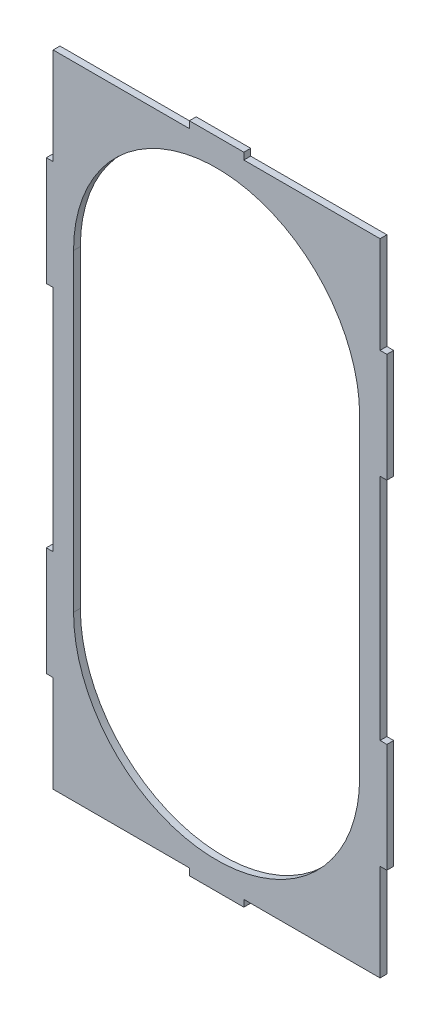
ISO-10303-21;
HEADER;
FILE_DESCRIPTION(('STEP AP214'),'2;1');
FILE_NAME('part.step','',(''),(''),'','','');
FILE_SCHEMA(('AUTOMOTIVE_DESIGN { 1 0 10303 214 1 1 1 1 }'));
ENDSEC;
DATA;
#1=APPLICATION_CONTEXT('core data for automotive mechanical design processes');
#2=APPLICATION_PROTOCOL_DEFINITION('international standard','automotive_design',2000,#1);
#3=PRODUCT_CONTEXT('',#1,'mechanical');
#4=PRODUCT('Part','Part','',(#3));
#5=PRODUCT_RELATED_PRODUCT_CATEGORY('part','',(#4));
#6=PRODUCT_DEFINITION_FORMATION('','',#4);
#7=PRODUCT_DEFINITION_CONTEXT('part definition',#1,'design');
#8=PRODUCT_DEFINITION('design','',#6,#7);
#9=PRODUCT_DEFINITION_SHAPE('','',#8);
#10=(LENGTH_UNIT() NAMED_UNIT(*) SI_UNIT(.MILLI.,.METRE.));
#11=(NAMED_UNIT(*) PLANE_ANGLE_UNIT() SI_UNIT($,.RADIAN.));
#12=(NAMED_UNIT(*) SI_UNIT($,.STERADIAN.) SOLID_ANGLE_UNIT());
#13=UNCERTAINTY_MEASURE_WITH_UNIT(LENGTH_MEASURE(1.E-05),#10,'distance_accuracy_value','');
#14=(GEOMETRIC_REPRESENTATION_CONTEXT(3) GLOBAL_UNCERTAINTY_ASSIGNED_CONTEXT((#13)) GLOBAL_UNIT_ASSIGNED_CONTEXT((#10,
#11,#12)) REPRESENTATION_CONTEXT('',''));
#15=CARTESIAN_POINT('',(0.,0.,0.));
#16=DIRECTION('',(0.,0.,1.));
#17=DIRECTION('',(1.,0.,0.));
#18=AXIS2_PLACEMENT_3D('',#15,#16,#17);
#19=CARTESIAN_POINT('',(-68.9150193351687,13.2181613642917,3.175));
#20=DIRECTION('',(0.,0.,-1.));
#21=DIRECTION('',(-1.,0.,0.));
#22=AXIS2_PLACEMENT_3D('',#19,#20,#21);
#23=PLANE('',#22);
#24=DIRECTION('',(0.,-1.,0.));
#25=VECTOR('',#24,1.);
#26=CARTESIAN_POINT('',(-68.9150193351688,58.3031613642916,3.175));
#27=LINE('',#26,#25);
#28=CARTESIAN_POINT('',(-68.9150193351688,58.3031613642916,3.175));
#29=VERTEX_POINT('',#28);
#30=CARTESIAN_POINT('',(-68.9150193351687,13.2181613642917,3.175));
#31=VERTEX_POINT('',#30);
#32=EDGE_CURVE('E277',#29,#31,#27,.T.);
#33=ORIENTED_EDGE('',*,*,#32,.T.);
#34=DIRECTION('',(-1.,0.,0.));
#35=VECTOR('',#34,1.);
#36=CARTESIAN_POINT('',(-68.9150193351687,13.2181613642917,3.175));
#37=LINE('',#36,#35);
#38=CARTESIAN_POINT('',(-72.0900193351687,13.2181613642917,3.175));
#39=VERTEX_POINT('',#38);
#40=EDGE_CURVE('E280',#31,#39,#37,.T.);
#41=ORIENTED_EDGE('',*,*,#40,.T.);
#42=DIRECTION('',(0.,-1.,0.));
#43=VECTOR('',#42,1.);
#44=CARTESIAN_POINT('',(-72.0900193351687,13.2181613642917,3.175));
#45=LINE('',#44,#43);
#46=CARTESIAN_POINT('',(-72.0900193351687,-37.5818386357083,3.175));
#47=VERTEX_POINT('',#46);
#48=EDGE_CURVE('E283',#39,#47,#45,.T.);
#49=ORIENTED_EDGE('',*,*,#48,.T.);
#50=DIRECTION('',(1.,0.,0.));
#51=VECTOR('',#50,1.);
#52=CARTESIAN_POINT('',(-68.9150193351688,-37.5818386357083,3.175));
#53=LINE('',#52,#51);
#54=CARTESIAN_POINT('',(-68.9150193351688,-37.5818386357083,3.175));
#55=VERTEX_POINT('',#54);
#56=EDGE_CURVE('E285',#47,#55,#53,.T.);
#57=ORIENTED_EDGE('',*,*,#56,.T.);
#58=DIRECTION('',(0.,-1.,0.));
#59=VECTOR('',#58,1.);
#60=CARTESIAN_POINT('',(-68.9150193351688,-37.5818386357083,3.175));
#61=LINE('',#60,#59);
#62=CARTESIAN_POINT('',(-68.9150193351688,-144.261838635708,3.175));
#63=VERTEX_POINT('',#62);
#64=EDGE_CURVE('E287',#55,#63,#61,.T.);
#65=ORIENTED_EDGE('',*,*,#64,.T.);
#66=DIRECTION('',(-1.,0.,0.));
#67=VECTOR('',#66,1.);
#68=CARTESIAN_POINT('',(-68.9150193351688,-144.261838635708,3.175));
#69=LINE('',#68,#67);
#70=CARTESIAN_POINT('',(-72.0900193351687,-144.261838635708,3.175));
#71=VERTEX_POINT('',#70);
#72=EDGE_CURVE('E289',#63,#71,#69,.T.);
#73=ORIENTED_EDGE('',*,*,#72,.T.);
#74=DIRECTION('',(0.,-1.,0.));
#75=VECTOR('',#74,1.);
#76=CARTESIAN_POINT('',(-72.0900193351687,-144.261838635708,3.175));
#77=LINE('',#76,#75);
#78=CARTESIAN_POINT('',(-72.0900193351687,-195.061838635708,3.175));
#79=VERTEX_POINT('',#78);
#80=EDGE_CURVE('E291',#71,#79,#77,.T.);
#81=ORIENTED_EDGE('',*,*,#80,.T.);
#82=DIRECTION('',(1.,0.,0.));
#83=VECTOR('',#82,1.);
#84=CARTESIAN_POINT('',(-68.9150193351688,-195.061838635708,3.175));
#85=LINE('',#84,#83);
#86=CARTESIAN_POINT('',(-68.9150193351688,-195.061838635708,3.175));
#87=VERTEX_POINT('',#86);
#88=EDGE_CURVE('E293',#79,#87,#85,.T.);
#89=ORIENTED_EDGE('',*,*,#88,.T.);
#90=DIRECTION('',(0.,-1.,0.));
#91=VECTOR('',#90,1.);
#92=CARTESIAN_POINT('',(-68.9150193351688,-195.061838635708,3.175));
#93=LINE('',#92,#91);
#94=CARTESIAN_POINT('',(-68.9150193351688,-240.146838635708,3.175));
#95=VERTEX_POINT('',#94);
#96=EDGE_CURVE('E295',#87,#95,#93,.T.);
#97=ORIENTED_EDGE('',*,*,#96,.T.);
#98=DIRECTION('',(1.,0.,0.));
#99=VECTOR('',#98,1.);
#100=CARTESIAN_POINT('',(-68.9150193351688,-240.146838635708,3.175));
#101=LINE('',#100,#99);
#102=CARTESIAN_POINT('',(-5.41501933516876,-240.146838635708,3.175));
#103=VERTEX_POINT('',#102);
#104=EDGE_CURVE('E297',#95,#103,#101,.T.);
#105=ORIENTED_EDGE('',*,*,#104,.T.);
#106=DIRECTION('',(0.,-1.,0.));
#107=VECTOR('',#106,1.);
#108=CARTESIAN_POINT('',(-5.41501933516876,-240.146838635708,3.175));
#109=LINE('',#108,#107);
#110=CARTESIAN_POINT('',(-5.41501933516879,-243.321838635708,3.175));
#111=VERTEX_POINT('',#110);
#112=EDGE_CURVE('E299',#103,#111,#109,.T.);
#113=ORIENTED_EDGE('',*,*,#112,.T.);
#114=DIRECTION('',(1.,0.,0.));
#115=VECTOR('',#114,1.);
#116=CARTESIAN_POINT('',(-5.41501933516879,-243.321838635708,3.175));
#117=LINE('',#116,#115);
#118=CARTESIAN_POINT('',(19.9849806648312,-243.321838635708,3.175));
#119=VERTEX_POINT('',#118);
#120=EDGE_CURVE('E301',#111,#119,#117,.T.);
#121=ORIENTED_EDGE('',*,*,#120,.T.);
#122=DIRECTION('',(0.,1.,0.));
#123=VECTOR('',#122,1.);
#124=CARTESIAN_POINT('',(19.9849806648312,-240.146838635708,3.175));
#125=LINE('',#124,#123);
#126=CARTESIAN_POINT('',(19.9849806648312,-240.146838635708,3.175));
#127=VERTEX_POINT('',#126);
#128=EDGE_CURVE('E303',#119,#127,#125,.T.);
#129=ORIENTED_EDGE('',*,*,#128,.T.);
#130=DIRECTION('',(1.,0.,0.));
#131=VECTOR('',#130,1.);
#132=CARTESIAN_POINT('',(19.9849806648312,-240.146838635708,3.175));
#133=LINE('',#132,#131);
#134=CARTESIAN_POINT('',(83.4849806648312,-240.146838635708,3.175));
#135=VERTEX_POINT('',#134);
#136=EDGE_CURVE('E305',#127,#135,#133,.T.);
#137=ORIENTED_EDGE('',*,*,#136,.T.);
#138=DIRECTION('',(0.,1.,0.));
#139=VECTOR('',#138,1.);
#140=CARTESIAN_POINT('',(83.4849806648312,-195.061838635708,3.175));
#141=LINE('',#140,#139);
#142=CARTESIAN_POINT('',(83.4849806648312,-195.061838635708,3.175));
#143=VERTEX_POINT('',#142);
#144=EDGE_CURVE('E307',#135,#143,#141,.T.);
#145=ORIENTED_EDGE('',*,*,#144,.T.);
#146=DIRECTION('',(1.,0.,0.));
#147=VECTOR('',#146,1.);
#148=CARTESIAN_POINT('',(83.4849806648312,-195.061838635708,3.175));
#149=LINE('',#148,#147);
#150=CARTESIAN_POINT('',(86.6599806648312,-195.061838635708,3.175));
#151=VERTEX_POINT('',#150);
#152=EDGE_CURVE('E309',#143,#151,#149,.T.);
#153=ORIENTED_EDGE('',*,*,#152,.T.);
#154=DIRECTION('',(0.,1.,0.));
#155=VECTOR('',#154,1.);
#156=CARTESIAN_POINT('',(86.6599806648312,-144.261838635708,3.175));
#157=LINE('',#156,#155);
#158=CARTESIAN_POINT('',(86.6599806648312,-144.261838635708,3.175));
#159=VERTEX_POINT('',#158);
#160=EDGE_CURVE('E311',#151,#159,#157,.T.);
#161=ORIENTED_EDGE('',*,*,#160,.T.);
#162=DIRECTION('',(-1.,0.,0.));
#163=VECTOR('',#162,1.);
#164=CARTESIAN_POINT('',(83.4849806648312,-144.261838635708,3.175));
#165=LINE('',#164,#163);
#166=CARTESIAN_POINT('',(83.4849806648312,-144.261838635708,3.175));
#167=VERTEX_POINT('',#166);
#168=EDGE_CURVE('E313',#159,#167,#165,.T.);
#169=ORIENTED_EDGE('',*,*,#168,.T.);
#170=DIRECTION('',(0.,1.,0.));
#171=VECTOR('',#170,1.);
#172=CARTESIAN_POINT('',(83.4849806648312,-37.5818386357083,3.175));
#173=LINE('',#172,#171);
#174=CARTESIAN_POINT('',(83.4849806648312,-37.5818386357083,3.175));
#175=VERTEX_POINT('',#174);
#176=EDGE_CURVE('E315',#167,#175,#173,.T.);
#177=ORIENTED_EDGE('',*,*,#176,.T.);
#178=DIRECTION('',(1.,0.,0.));
#179=VECTOR('',#178,1.);
#180=CARTESIAN_POINT('',(83.4849806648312,-37.5818386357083,3.175));
#181=LINE('',#180,#179);
#182=CARTESIAN_POINT('',(86.6599806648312,-37.5818386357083,3.175));
#183=VERTEX_POINT('',#182);
#184=EDGE_CURVE('E317',#175,#183,#181,.T.);
#185=ORIENTED_EDGE('',*,*,#184,.T.);
#186=DIRECTION('',(0.,1.,0.));
#187=VECTOR('',#186,1.);
#188=CARTESIAN_POINT('',(86.6599806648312,13.2181613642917,3.175));
#189=LINE('',#188,#187);
#190=CARTESIAN_POINT('',(86.6599806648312,13.2181613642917,3.175));
#191=VERTEX_POINT('',#190);
#192=EDGE_CURVE('E319',#183,#191,#189,.T.);
#193=ORIENTED_EDGE('',*,*,#192,.T.);
#194=DIRECTION('',(-1.,0.,0.));
#195=VECTOR('',#194,1.);
#196=CARTESIAN_POINT('',(83.4849806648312,13.2181613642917,3.175));
#197=LINE('',#196,#195);
#198=CARTESIAN_POINT('',(83.4849806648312,13.2181613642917,3.175));
#199=VERTEX_POINT('',#198);
#200=EDGE_CURVE('E321',#191,#199,#197,.T.);
#201=ORIENTED_EDGE('',*,*,#200,.T.);
#202=DIRECTION('',(0.,1.,0.));
#203=VECTOR('',#202,1.);
#204=CARTESIAN_POINT('',(83.4849806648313,58.3031613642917,3.175));
#205=LINE('',#204,#203);
#206=CARTESIAN_POINT('',(83.4849806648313,58.3031613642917,3.175));
#207=VERTEX_POINT('',#206);
#208=EDGE_CURVE('E323',#199,#207,#205,.T.);
#209=ORIENTED_EDGE('',*,*,#208,.T.);
#210=DIRECTION('',(-1.,0.,0.));
#211=VECTOR('',#210,1.);
#212=CARTESIAN_POINT('',(19.9849806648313,58.3031613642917,3.175));
#213=LINE('',#212,#211);
#214=CARTESIAN_POINT('',(19.9849806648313,58.3031613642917,3.175));
#215=VERTEX_POINT('',#214);
#216=EDGE_CURVE('E325',#207,#215,#213,.T.);
#217=ORIENTED_EDGE('',*,*,#216,.T.);
#218=DIRECTION('',(0.,1.,0.));
#219=VECTOR('',#218,1.);
#220=CARTESIAN_POINT('',(19.9849806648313,58.3031613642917,3.175));
#221=LINE('',#220,#219);
#222=CARTESIAN_POINT('',(19.9849806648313,61.4781613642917,3.175));
#223=VERTEX_POINT('',#222);
#224=EDGE_CURVE('E327',#215,#223,#221,.T.);
#225=ORIENTED_EDGE('',*,*,#224,.T.);
#226=DIRECTION('',(-1.,0.,0.));
#227=VECTOR('',#226,1.);
#228=CARTESIAN_POINT('',(-5.41501933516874,61.4781613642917,3.175));
#229=LINE('',#228,#227);
#230=CARTESIAN_POINT('',(-5.41501933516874,61.4781613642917,3.175));
#231=VERTEX_POINT('',#230);
#232=EDGE_CURVE('E329',#223,#231,#229,.T.);
#233=ORIENTED_EDGE('',*,*,#232,.T.);
#234=DIRECTION('',(0.,-1.,0.));
#235=VECTOR('',#234,1.);
#236=CARTESIAN_POINT('',(-5.41501933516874,58.3031613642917,3.175));
#237=LINE('',#236,#235);
#238=CARTESIAN_POINT('',(-5.41501933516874,58.3031613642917,3.175));
#239=VERTEX_POINT('',#238);
#240=EDGE_CURVE('E331',#231,#239,#237,.T.);
#241=ORIENTED_EDGE('',*,*,#240,.T.);
#242=DIRECTION('',(-1.,0.,0.));
#243=VECTOR('',#242,1.);
#244=CARTESIAN_POINT('',(-68.9150193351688,58.3031613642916,3.175));
#245=LINE('',#244,#243);
#246=EDGE_CURVE('E333',#239,#29,#245,.T.);
#247=ORIENTED_EDGE('',*,*,#246,.T.);
#248=EDGE_LOOP('',(#33,#41,#49,#57,#65,#73,#81,#89,#97,#105,#113,#121,#129,#137,#145,#153,#161,
#169,#177,#185,#193,#201,#209,#217,#225,#233,#241,#247));
#249=FACE_BOUND('',#248,.T.);
#250=CARTESIAN_POINT('',(7.28498066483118,-17.8968386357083,3.175));
#251=DIRECTION('',(0.,0.,1.));
#252=DIRECTION('',(1.,0.,0.));
#253=AXIS2_PLACEMENT_3D('',#250,#251,#252);
#254=CIRCLE('',#253,66.6749999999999);
#255=CARTESIAN_POINT('',(73.9599806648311,-17.8968386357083,3.175));
#256=VERTEX_POINT('',#255);
#257=CARTESIAN_POINT('',(-59.3900193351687,-17.8968386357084,3.175));
#258=VERTEX_POINT('',#257);
#259=EDGE_CURVE('E241',#256,#258,#254,.T.);
#260=ORIENTED_EDGE('',*,*,#259,.F.);
#261=DIRECTION('',(0.,1.,0.));
#262=VECTOR('',#261,1.);
#263=CARTESIAN_POINT('',(73.9599806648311,-17.8968386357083,3.175));
#264=LINE('',#263,#262);
#265=CARTESIAN_POINT('',(73.9599806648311,-163.946838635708,3.175));
#266=VERTEX_POINT('',#265);
#267=EDGE_CURVE('E263',#266,#256,#264,.T.);
#268=ORIENTED_EDGE('',*,*,#267,.F.);
#269=CARTESIAN_POINT('',(7.28498066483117,-163.946838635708,3.175));
#270=DIRECTION('',(0.,0.,1.));
#271=DIRECTION('',(1.,0.,0.));
#272=AXIS2_PLACEMENT_3D('',#269,#270,#271);
#273=CIRCLE('',#272,66.6749999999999);
#274=CARTESIAN_POINT('',(-59.3900193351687,-163.946838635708,3.175));
#275=VERTEX_POINT('',#274);
#276=EDGE_CURVE('E261',#275,#266,#273,.T.);
#277=ORIENTED_EDGE('',*,*,#276,.F.);
#278=DIRECTION('',(0.,-1.,0.));
#279=VECTOR('',#278,1.);
#280=CARTESIAN_POINT('',(-59.3900193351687,-17.8968386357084,3.175));
#281=LINE('',#280,#279);
#282=EDGE_CURVE('E249',#258,#275,#281,.T.);
#283=ORIENTED_EDGE('',*,*,#282,.F.);
#284=EDGE_LOOP('',(#260,#268,#277,#283));
#285=FACE_BOUND('',#284,.T.);
#286=ADVANCED_FACE('F32',(#249,#285),#23,.F.);
#287=CARTESIAN_POINT('',(-68.9150193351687,13.2181613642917,0.));
#288=DIRECTION('',(0.,0.,-1.));
#289=DIRECTION('',(-1.,0.,0.));
#290=AXIS2_PLACEMENT_3D('',#287,#288,#289);
#291=PLANE('',#290);
#292=DIRECTION('',(0.,-1.,0.));
#293=VECTOR('',#292,1.);
#294=CARTESIAN_POINT('',(-68.9150193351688,58.3031613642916,0.));
#295=LINE('',#294,#293);
#296=CARTESIAN_POINT('',(-68.9150193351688,58.3031613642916,0.));
#297=VERTEX_POINT('',#296);
#298=CARTESIAN_POINT('',(-68.9150193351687,13.2181613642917,0.));
#299=VERTEX_POINT('',#298);
#300=EDGE_CURVE('E257',#297,#299,#295,.T.);
#301=ORIENTED_EDGE('',*,*,#300,.F.);
#302=DIRECTION('',(-1.,0.,0.));
#303=VECTOR('',#302,1.);
#304=CARTESIAN_POINT('',(-68.9150193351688,58.3031613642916,0.));
#305=LINE('',#304,#303);
#306=CARTESIAN_POINT('',(-5.41501933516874,58.3031613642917,0.));
#307=VERTEX_POINT('',#306);
#308=EDGE_CURVE('E281',#307,#297,#305,.T.);
#309=ORIENTED_EDGE('',*,*,#308,.F.);
#310=DIRECTION('',(0.,-1.,0.));
#311=VECTOR('',#310,1.);
#312=CARTESIAN_POINT('',(-5.41501933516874,58.3031613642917,0.));
#313=LINE('',#312,#311);
#314=CARTESIAN_POINT('',(-5.41501933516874,61.4781613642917,0.));
#315=VERTEX_POINT('',#314);
#316=EDGE_CURVE('E388',#315,#307,#313,.T.);
#317=ORIENTED_EDGE('',*,*,#316,.F.);
#318=DIRECTION('',(-1.,0.,0.));
#319=VECTOR('',#318,1.);
#320=CARTESIAN_POINT('',(-5.41501933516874,61.4781613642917,0.));
#321=LINE('',#320,#319);
#322=CARTESIAN_POINT('',(19.9849806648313,61.4781613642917,0.));
#323=VERTEX_POINT('',#322);
#324=EDGE_CURVE('E386',#323,#315,#321,.T.);
#325=ORIENTED_EDGE('',*,*,#324,.F.);
#326=DIRECTION('',(0.,1.,0.));
#327=VECTOR('',#326,1.);
#328=CARTESIAN_POINT('',(19.9849806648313,58.3031613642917,0.));
#329=LINE('',#328,#327);
#330=CARTESIAN_POINT('',(19.9849806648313,58.3031613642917,0.));
#331=VERTEX_POINT('',#330);
#332=EDGE_CURVE('E384',#331,#323,#329,.T.);
#333=ORIENTED_EDGE('',*,*,#332,.F.);
#334=DIRECTION('',(-1.,0.,0.));
#335=VECTOR('',#334,1.);
#336=CARTESIAN_POINT('',(19.9849806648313,58.3031613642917,0.));
#337=LINE('',#336,#335);
#338=CARTESIAN_POINT('',(83.4849806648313,58.3031613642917,0.));
#339=VERTEX_POINT('',#338);
#340=EDGE_CURVE('E382',#339,#331,#337,.T.);
#341=ORIENTED_EDGE('',*,*,#340,.F.);
#342=DIRECTION('',(0.,1.,0.));
#343=VECTOR('',#342,1.);
#344=CARTESIAN_POINT('',(83.4849806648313,58.3031613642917,0.));
#345=LINE('',#344,#343);
#346=CARTESIAN_POINT('',(83.4849806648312,13.2181613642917,0.));
#347=VERTEX_POINT('',#346);
#348=EDGE_CURVE('E380',#347,#339,#345,.T.);
#349=ORIENTED_EDGE('',*,*,#348,.F.);
#350=DIRECTION('',(-1.,0.,0.));
#351=VECTOR('',#350,1.);
#352=CARTESIAN_POINT('',(83.4849806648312,13.2181613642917,0.));
#353=LINE('',#352,#351);
#354=CARTESIAN_POINT('',(86.6599806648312,13.2181613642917,0.));
#355=VERTEX_POINT('',#354);
#356=EDGE_CURVE('E378',#355,#347,#353,.T.);
#357=ORIENTED_EDGE('',*,*,#356,.F.);
#358=DIRECTION('',(0.,1.,0.));
#359=VECTOR('',#358,1.);
#360=CARTESIAN_POINT('',(86.6599806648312,13.2181613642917,0.));
#361=LINE('',#360,#359);
#362=CARTESIAN_POINT('',(86.6599806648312,-37.5818386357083,0.));
#363=VERTEX_POINT('',#362);
#364=EDGE_CURVE('E376',#363,#355,#361,.T.);
#365=ORIENTED_EDGE('',*,*,#364,.F.);
#366=DIRECTION('',(1.,0.,0.));
#367=VECTOR('',#366,1.);
#368=CARTESIAN_POINT('',(83.4849806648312,-37.5818386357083,0.));
#369=LINE('',#368,#367);
#370=CARTESIAN_POINT('',(83.4849806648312,-37.5818386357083,0.));
#371=VERTEX_POINT('',#370);
#372=EDGE_CURVE('E374',#371,#363,#369,.T.);
#373=ORIENTED_EDGE('',*,*,#372,.F.);
#374=DIRECTION('',(0.,1.,0.));
#375=VECTOR('',#374,1.);
#376=CARTESIAN_POINT('',(83.4849806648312,-37.5818386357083,0.));
#377=LINE('',#376,#375);
#378=CARTESIAN_POINT('',(83.4849806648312,-144.261838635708,0.));
#379=VERTEX_POINT('',#378);
#380=EDGE_CURVE('E372',#379,#371,#377,.T.);
#381=ORIENTED_EDGE('',*,*,#380,.F.);
#382=DIRECTION('',(-1.,0.,0.));
#383=VECTOR('',#382,1.);
#384=CARTESIAN_POINT('',(83.4849806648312,-144.261838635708,0.));
#385=LINE('',#384,#383);
#386=CARTESIAN_POINT('',(86.6599806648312,-144.261838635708,0.));
#387=VERTEX_POINT('',#386);
#388=EDGE_CURVE('E370',#387,#379,#385,.T.);
#389=ORIENTED_EDGE('',*,*,#388,.F.);
#390=DIRECTION('',(0.,1.,0.));
#391=VECTOR('',#390,1.);
#392=CARTESIAN_POINT('',(86.6599806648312,-144.261838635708,0.));
#393=LINE('',#392,#391);
#394=CARTESIAN_POINT('',(86.6599806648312,-195.061838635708,0.));
#395=VERTEX_POINT('',#394);
#396=EDGE_CURVE('E368',#395,#387,#393,.T.);
#397=ORIENTED_EDGE('',*,*,#396,.F.);
#398=DIRECTION('',(1.,0.,0.));
#399=VECTOR('',#398,1.);
#400=CARTESIAN_POINT('',(83.4849806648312,-195.061838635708,0.));
#401=LINE('',#400,#399);
#402=CARTESIAN_POINT('',(83.4849806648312,-195.061838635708,0.));
#403=VERTEX_POINT('',#402);
#404=EDGE_CURVE('E366',#403,#395,#401,.T.);
#405=ORIENTED_EDGE('',*,*,#404,.F.);
#406=DIRECTION('',(0.,1.,0.));
#407=VECTOR('',#406,1.);
#408=CARTESIAN_POINT('',(83.4849806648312,-195.061838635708,0.));
#409=LINE('',#408,#407);
#410=CARTESIAN_POINT('',(83.4849806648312,-240.146838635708,0.));
#411=VERTEX_POINT('',#410);
#412=EDGE_CURVE('E364',#411,#403,#409,.T.);
#413=ORIENTED_EDGE('',*,*,#412,.F.);
#414=DIRECTION('',(1.,0.,0.));
#415=VECTOR('',#414,1.);
#416=CARTESIAN_POINT('',(19.9849806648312,-240.146838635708,0.));
#417=LINE('',#416,#415);
#418=CARTESIAN_POINT('',(19.9849806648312,-240.146838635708,0.));
#419=VERTEX_POINT('',#418);
#420=EDGE_CURVE('E362',#419,#411,#417,.T.);
#421=ORIENTED_EDGE('',*,*,#420,.F.);
#422=DIRECTION('',(0.,1.,0.));
#423=VECTOR('',#422,1.);
#424=CARTESIAN_POINT('',(19.9849806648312,-240.146838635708,0.));
#425=LINE('',#424,#423);
#426=CARTESIAN_POINT('',(19.9849806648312,-243.321838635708,0.));
#427=VERTEX_POINT('',#426);
#428=EDGE_CURVE('E360',#427,#419,#425,.T.);
#429=ORIENTED_EDGE('',*,*,#428,.F.);
#430=DIRECTION('',(1.,0.,0.));
#431=VECTOR('',#430,1.);
#432=CARTESIAN_POINT('',(-5.41501933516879,-243.321838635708,0.));
#433=LINE('',#432,#431);
#434=CARTESIAN_POINT('',(-5.41501933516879,-243.321838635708,0.));
#435=VERTEX_POINT('',#434);
#436=EDGE_CURVE('E358',#435,#427,#433,.T.);
#437=ORIENTED_EDGE('',*,*,#436,.F.);
#438=DIRECTION('',(0.,-1.,0.));
#439=VECTOR('',#438,1.);
#440=CARTESIAN_POINT('',(-5.41501933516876,-240.146838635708,0.));
#441=LINE('',#440,#439);
#442=CARTESIAN_POINT('',(-5.41501933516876,-240.146838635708,0.));
#443=VERTEX_POINT('',#442);
#444=EDGE_CURVE('E356',#443,#435,#441,.T.);
#445=ORIENTED_EDGE('',*,*,#444,.F.);
#446=DIRECTION('',(1.,0.,0.));
#447=VECTOR('',#446,1.);
#448=CARTESIAN_POINT('',(-68.9150193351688,-240.146838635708,0.));
#449=LINE('',#448,#447);
#450=CARTESIAN_POINT('',(-68.9150193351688,-240.146838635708,0.));
#451=VERTEX_POINT('',#450);
#452=EDGE_CURVE('E354',#451,#443,#449,.T.);
#453=ORIENTED_EDGE('',*,*,#452,.F.);
#454=DIRECTION('',(0.,-1.,0.));
#455=VECTOR('',#454,1.);
#456=CARTESIAN_POINT('',(-68.9150193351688,-195.061838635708,0.));
#457=LINE('',#456,#455);
#458=CARTESIAN_POINT('',(-68.9150193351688,-195.061838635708,0.));
#459=VERTEX_POINT('',#458);
#460=EDGE_CURVE('E352',#459,#451,#457,.T.);
#461=ORIENTED_EDGE('',*,*,#460,.F.);
#462=DIRECTION('',(1.,0.,0.));
#463=VECTOR('',#462,1.);
#464=CARTESIAN_POINT('',(-68.9150193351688,-195.061838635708,0.));
#465=LINE('',#464,#463);
#466=CARTESIAN_POINT('',(-72.0900193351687,-195.061838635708,0.));
#467=VERTEX_POINT('',#466);
#468=EDGE_CURVE('E350',#467,#459,#465,.T.);
#469=ORIENTED_EDGE('',*,*,#468,.F.);
#470=DIRECTION('',(0.,-1.,0.));
#471=VECTOR('',#470,1.);
#472=CARTESIAN_POINT('',(-72.0900193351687,-144.261838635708,0.));
#473=LINE('',#472,#471);
#474=CARTESIAN_POINT('',(-72.0900193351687,-144.261838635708,0.));
#475=VERTEX_POINT('',#474);
#476=EDGE_CURVE('E348',#475,#467,#473,.T.);
#477=ORIENTED_EDGE('',*,*,#476,.F.);
#478=DIRECTION('',(-1.,0.,0.));
#479=VECTOR('',#478,1.);
#480=CARTESIAN_POINT('',(-68.9150193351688,-144.261838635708,0.));
#481=LINE('',#480,#479);
#482=CARTESIAN_POINT('',(-68.9150193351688,-144.261838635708,0.));
#483=VERTEX_POINT('',#482);
#484=EDGE_CURVE('E346',#483,#475,#481,.T.);
#485=ORIENTED_EDGE('',*,*,#484,.F.);
#486=DIRECTION('',(0.,-1.,0.));
#487=VECTOR('',#486,1.);
#488=CARTESIAN_POINT('',(-68.9150193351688,-37.5818386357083,0.));
#489=LINE('',#488,#487);
#490=CARTESIAN_POINT('',(-68.9150193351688,-37.5818386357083,0.));
#491=VERTEX_POINT('',#490);
#492=EDGE_CURVE('E344',#491,#483,#489,.T.);
#493=ORIENTED_EDGE('',*,*,#492,.F.);
#494=DIRECTION('',(1.,0.,0.));
#495=VECTOR('',#494,1.);
#496=CARTESIAN_POINT('',(-68.9150193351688,-37.5818386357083,0.));
#497=LINE('',#496,#495);
#498=CARTESIAN_POINT('',(-72.0900193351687,-37.5818386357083,0.));
#499=VERTEX_POINT('',#498);
#500=EDGE_CURVE('E342',#499,#491,#497,.T.);
#501=ORIENTED_EDGE('',*,*,#500,.F.);
#502=DIRECTION('',(0.,-1.,0.));
#503=VECTOR('',#502,1.);
#504=CARTESIAN_POINT('',(-72.0900193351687,13.2181613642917,0.));
#505=LINE('',#504,#503);
#506=CARTESIAN_POINT('',(-72.0900193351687,13.2181613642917,0.));
#507=VERTEX_POINT('',#506);
#508=EDGE_CURVE('E340',#507,#499,#505,.T.);
#509=ORIENTED_EDGE('',*,*,#508,.F.);
#510=DIRECTION('',(-1.,0.,0.));
#511=VECTOR('',#510,1.);
#512=CARTESIAN_POINT('',(-68.9150193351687,13.2181613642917,0.));
#513=LINE('',#512,#511);
#514=EDGE_CURVE('E338',#299,#507,#513,.T.);
#515=ORIENTED_EDGE('',*,*,#514,.F.);
#516=EDGE_LOOP('',(#301,#309,#317,#325,#333,#341,#349,#357,#365,#373,#381,#389,#397,#405,#413,
#421,#429,#437,#445,#453,#461,#469,#477,#485,#493,#501,#509,#515));
#517=FACE_BOUND('',#516,.T.);
#518=DIRECTION('',(0.,1.,0.));
#519=VECTOR('',#518,1.);
#520=CARTESIAN_POINT('',(73.9599806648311,-17.8968386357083,0.));
#521=LINE('',#520,#519);
#522=CARTESIAN_POINT('',(73.9599806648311,-163.946838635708,0.));
#523=VERTEX_POINT('',#522);
#524=CARTESIAN_POINT('',(73.9599806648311,-17.8968386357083,0.));
#525=VERTEX_POINT('',#524);
#526=EDGE_CURVE('E250',#523,#525,#521,.T.);
#527=ORIENTED_EDGE('',*,*,#526,.T.);
#528=CARTESIAN_POINT('',(7.28498066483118,-17.8968386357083,0.));
#529=DIRECTION('',(0.,0.,1.));
#530=DIRECTION('',(1.,0.,0.));
#531=AXIS2_PLACEMENT_3D('',#528,#529,#530);
#532=CIRCLE('',#531,66.6749999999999);
#533=CARTESIAN_POINT('',(-59.3900193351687,-17.8968386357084,0.));
#534=VERTEX_POINT('',#533);
#535=EDGE_CURVE('E55',#525,#534,#532,.T.);
#536=ORIENTED_EDGE('',*,*,#535,.T.);
#537=DIRECTION('',(0.,-1.,0.));
#538=VECTOR('',#537,1.);
#539=CARTESIAN_POINT('',(-59.3900193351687,-17.8968386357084,0.));
#540=LINE('',#539,#538);
#541=CARTESIAN_POINT('',(-59.3900193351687,-163.946838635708,0.));
#542=VERTEX_POINT('',#541);
#543=EDGE_CURVE('E256',#534,#542,#540,.T.);
#544=ORIENTED_EDGE('',*,*,#543,.T.);
#545=CARTESIAN_POINT('',(7.28498066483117,-163.946838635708,0.));
#546=DIRECTION('',(0.,0.,1.));
#547=DIRECTION('',(1.,0.,0.));
#548=AXIS2_PLACEMENT_3D('',#545,#546,#547);
#549=CIRCLE('',#548,66.6749999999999);
#550=EDGE_CURVE('E269',#542,#523,#549,.T.);
#551=ORIENTED_EDGE('',*,*,#550,.T.);
#552=EDGE_LOOP('',(#527,#536,#544,#551));
#553=FACE_BOUND('',#552,.T.);
#554=ADVANCED_FACE('F478',(#517,#553),#291,.T.);
#555=CARTESIAN_POINT('',(-68.9150193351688,58.3031613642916,3.175));
#556=DIRECTION('',(1.,0.,0.));
#557=DIRECTION('',(0.,1.,0.));
#558=AXIS2_PLACEMENT_3D('',#555,#556,#557);
#559=PLANE('',#558);
#560=ORIENTED_EDGE('',*,*,#300,.T.);
#561=DIRECTION('',(0.,0.,-1.));
#562=VECTOR('',#561,1.);
#563=CARTESIAN_POINT('',(-68.9150193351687,13.2181613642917,3.175));
#564=LINE('',#563,#562);
#565=EDGE_CURVE('E11',#31,#299,#564,.T.);
#566=ORIENTED_EDGE('',*,*,#565,.F.);
#567=ORIENTED_EDGE('',*,*,#32,.F.);
#568=DIRECTION('',(0.,0.,-1.));
#569=VECTOR('',#568,1.);
#570=CARTESIAN_POINT('',(-68.9150193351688,58.3031613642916,3.175));
#571=LINE('',#570,#569);
#572=EDGE_CURVE('E335',#29,#297,#571,.T.);
#573=ORIENTED_EDGE('',*,*,#572,.T.);
#574=EDGE_LOOP('',(#560,#566,#567,#573));
#575=FACE_BOUND('',#574,.T.);
#576=ADVANCED_FACE('F34',(#575),#559,.F.);
#577=CARTESIAN_POINT('',(-68.9150193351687,13.2181613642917,3.175));
#578=DIRECTION('',(0.,-1.,0.));
#579=DIRECTION('',(0.,0.,-1.));
#580=AXIS2_PLACEMENT_3D('',#577,#578,#579);
#581=PLANE('',#580);
#582=ORIENTED_EDGE('',*,*,#514,.T.);
#583=DIRECTION('',(0.,0.,-1.));
#584=VECTOR('',#583,1.);
#585=CARTESIAN_POINT('',(-72.0900193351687,13.2181613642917,3.175));
#586=LINE('',#585,#584);
#587=EDGE_CURVE('E40',#39,#507,#586,.T.);
#588=ORIENTED_EDGE('',*,*,#587,.F.);
#589=ORIENTED_EDGE('',*,*,#40,.F.);
#590=ORIENTED_EDGE('',*,*,#565,.T.);
#591=EDGE_LOOP('',(#582,#588,#589,#590));
#592=FACE_BOUND('',#591,.T.);
#593=ADVANCED_FACE('F495',(#592),#581,.F.);
#594=CARTESIAN_POINT('',(-72.0900193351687,13.2181613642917,3.175));
#595=DIRECTION('',(1.,0.,0.));
#596=DIRECTION('',(0.,1.,0.));
#597=AXIS2_PLACEMENT_3D('',#594,#595,#596);
#598=PLANE('',#597);
#599=ORIENTED_EDGE('',*,*,#508,.T.);
#600=DIRECTION('',(0.,0.,-1.));
#601=VECTOR('',#600,1.);
#602=CARTESIAN_POINT('',(-72.0900193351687,-37.5818386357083,3.175));
#603=LINE('',#602,#601);
#604=EDGE_CURVE('E465',#47,#499,#603,.T.);
#605=ORIENTED_EDGE('',*,*,#604,.F.);
#606=ORIENTED_EDGE('',*,*,#48,.F.);
#607=ORIENTED_EDGE('',*,*,#587,.T.);
#608=EDGE_LOOP('',(#599,#605,#606,#607));
#609=FACE_BOUND('',#608,.T.);
#610=ADVANCED_FACE('F472',(#609),#598,.F.);
#611=CARTESIAN_POINT('',(-68.9150193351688,-37.5818386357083,3.175));
#612=DIRECTION('',(0.,1.,0.));
#613=DIRECTION('',(0.,0.,1.));
#614=AXIS2_PLACEMENT_3D('',#611,#612,#613);
#615=PLANE('',#614);
#616=ORIENTED_EDGE('',*,*,#500,.T.);
#617=DIRECTION('',(0.,0.,-1.));
#618=VECTOR('',#617,1.);
#619=CARTESIAN_POINT('',(-68.9150193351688,-37.5818386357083,3.175));
#620=LINE('',#619,#618);
#621=EDGE_CURVE('E462',#55,#491,#620,.T.);
#622=ORIENTED_EDGE('',*,*,#621,.F.);
#623=ORIENTED_EDGE('',*,*,#56,.F.);
#624=ORIENTED_EDGE('',*,*,#604,.T.);
#625=EDGE_LOOP('',(#616,#622,#623,#624));
#626=FACE_BOUND('',#625,.T.);
#627=ADVANCED_FACE('F484',(#626),#615,.F.);
#628=CARTESIAN_POINT('',(-68.9150193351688,-37.5818386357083,3.175));
#629=DIRECTION('',(1.,0.,0.));
#630=DIRECTION('',(0.,1.,0.));
#631=AXIS2_PLACEMENT_3D('',#628,#629,#630);
#632=PLANE('',#631);
#633=ORIENTED_EDGE('',*,*,#492,.T.);
#634=DIRECTION('',(0.,0.,-1.));
#635=VECTOR('',#634,1.);
#636=CARTESIAN_POINT('',(-68.9150193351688,-144.261838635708,3.175));
#637=LINE('',#636,#635);
#638=EDGE_CURVE('E459',#63,#483,#637,.T.);
#639=ORIENTED_EDGE('',*,*,#638,.F.);
#640=ORIENTED_EDGE('',*,*,#64,.F.);
#641=ORIENTED_EDGE('',*,*,#621,.T.);
#642=EDGE_LOOP('',(#633,#639,#640,#641));
#643=FACE_BOUND('',#642,.T.);
#644=ADVANCED_FACE('F488',(#643),#632,.F.);
#645=CARTESIAN_POINT('',(-68.9150193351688,-144.261838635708,3.175));
#646=DIRECTION('',(0.,-1.,0.));
#647=DIRECTION('',(0.,0.,-1.));
#648=AXIS2_PLACEMENT_3D('',#645,#646,#647);
#649=PLANE('',#648);
#650=ORIENTED_EDGE('',*,*,#484,.T.);
#651=DIRECTION('',(0.,0.,-1.));
#652=VECTOR('',#651,1.);
#653=CARTESIAN_POINT('',(-72.0900193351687,-144.261838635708,3.175));
#654=LINE('',#653,#652);
#655=EDGE_CURVE('E456',#71,#475,#654,.T.);
#656=ORIENTED_EDGE('',*,*,#655,.F.);
#657=ORIENTED_EDGE('',*,*,#72,.F.);
#658=ORIENTED_EDGE('',*,*,#638,.T.);
#659=EDGE_LOOP('',(#650,#656,#657,#658));
#660=FACE_BOUND('',#659,.T.);
#661=ADVANCED_FACE('F608',(#660),#649,.F.);
#662=CARTESIAN_POINT('',(-72.0900193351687,-144.261838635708,3.175));
#663=DIRECTION('',(1.,0.,0.));
#664=DIRECTION('',(0.,1.,0.));
#665=AXIS2_PLACEMENT_3D('',#662,#663,#664);
#666=PLANE('',#665);
#667=ORIENTED_EDGE('',*,*,#476,.T.);
#668=DIRECTION('',(0.,0.,-1.));
#669=VECTOR('',#668,1.);
#670=CARTESIAN_POINT('',(-72.0900193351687,-195.061838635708,3.175));
#671=LINE('',#670,#669);
#672=EDGE_CURVE('E453',#79,#467,#671,.T.);
#673=ORIENTED_EDGE('',*,*,#672,.F.);
#674=ORIENTED_EDGE('',*,*,#80,.F.);
#675=ORIENTED_EDGE('',*,*,#655,.T.);
#676=EDGE_LOOP('',(#667,#673,#674,#675));
#677=FACE_BOUND('',#676,.T.);
#678=ADVANCED_FACE('F605',(#677),#666,.F.);
#679=CARTESIAN_POINT('',(-68.9150193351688,-195.061838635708,3.175));
#680=DIRECTION('',(0.,1.,0.));
#681=DIRECTION('',(0.,0.,1.));
#682=AXIS2_PLACEMENT_3D('',#679,#680,#681);
#683=PLANE('',#682);
#684=ORIENTED_EDGE('',*,*,#468,.T.);
#685=DIRECTION('',(0.,0.,-1.));
#686=VECTOR('',#685,1.);
#687=CARTESIAN_POINT('',(-68.9150193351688,-195.061838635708,3.175));
#688=LINE('',#687,#686);
#689=EDGE_CURVE('E450',#87,#459,#688,.T.);
#690=ORIENTED_EDGE('',*,*,#689,.F.);
#691=ORIENTED_EDGE('',*,*,#88,.F.);
#692=ORIENTED_EDGE('',*,*,#672,.T.);
#693=EDGE_LOOP('',(#684,#690,#691,#692));
#694=FACE_BOUND('',#693,.T.);
#695=ADVANCED_FACE('F601',(#694),#683,.F.);
#696=CARTESIAN_POINT('',(-68.9150193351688,-195.061838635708,3.175));
#697=DIRECTION('',(1.,0.,0.));
#698=DIRECTION('',(0.,1.,0.));
#699=AXIS2_PLACEMENT_3D('',#696,#697,#698);
#700=PLANE('',#699);
#701=ORIENTED_EDGE('',*,*,#460,.T.);
#702=DIRECTION('',(0.,0.,-1.));
#703=VECTOR('',#702,1.);
#704=CARTESIAN_POINT('',(-68.9150193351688,-240.146838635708,3.175));
#705=LINE('',#704,#703);
#706=EDGE_CURVE('E447',#95,#451,#705,.T.);
#707=ORIENTED_EDGE('',*,*,#706,.F.);
#708=ORIENTED_EDGE('',*,*,#96,.F.);
#709=ORIENTED_EDGE('',*,*,#689,.T.);
#710=EDGE_LOOP('',(#701,#707,#708,#709));
#711=FACE_BOUND('',#710,.T.);
#712=ADVANCED_FACE('F597',(#711),#700,.F.);
#713=CARTESIAN_POINT('',(-68.9150193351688,-240.146838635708,3.175));
#714=DIRECTION('',(0.,1.,0.));
#715=DIRECTION('',(0.,0.,1.));
#716=AXIS2_PLACEMENT_3D('',#713,#714,#715);
#717=PLANE('',#716);
#718=ORIENTED_EDGE('',*,*,#452,.T.);
#719=DIRECTION('',(0.,0.,-1.));
#720=VECTOR('',#719,1.);
#721=CARTESIAN_POINT('',(-5.41501933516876,-240.146838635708,3.175));
#722=LINE('',#721,#720);
#723=EDGE_CURVE('E444',#103,#443,#722,.T.);
#724=ORIENTED_EDGE('',*,*,#723,.F.);
#725=ORIENTED_EDGE('',*,*,#104,.F.);
#726=ORIENTED_EDGE('',*,*,#706,.T.);
#727=EDGE_LOOP('',(#718,#724,#725,#726));
#728=FACE_BOUND('',#727,.T.);
#729=ADVANCED_FACE('F592',(#728),#717,.F.);
#730=CARTESIAN_POINT('',(-5.41501933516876,-240.146838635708,3.175));
#731=DIRECTION('',(1.,0.,0.));
#732=DIRECTION('',(0.,1.,0.));
#733=AXIS2_PLACEMENT_3D('',#730,#731,#732);
#734=PLANE('',#733);
#735=ORIENTED_EDGE('',*,*,#444,.T.);
#736=DIRECTION('',(0.,0.,-1.));
#737=VECTOR('',#736,1.);
#738=CARTESIAN_POINT('',(-5.41501933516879,-243.321838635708,3.175));
#739=LINE('',#738,#737);
#740=EDGE_CURVE('E441',#111,#435,#739,.T.);
#741=ORIENTED_EDGE('',*,*,#740,.F.);
#742=ORIENTED_EDGE('',*,*,#112,.F.);
#743=ORIENTED_EDGE('',*,*,#723,.T.);
#744=EDGE_LOOP('',(#735,#741,#742,#743));
#745=FACE_BOUND('',#744,.T.);
#746=ADVANCED_FACE('F586',(#745),#734,.F.);
#747=CARTESIAN_POINT('',(-5.41501933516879,-243.321838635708,3.175));
#748=DIRECTION('',(0.,1.,0.));
#749=DIRECTION('',(0.,0.,1.));
#750=AXIS2_PLACEMENT_3D('',#747,#748,#749);
#751=PLANE('',#750);
#752=ORIENTED_EDGE('',*,*,#436,.T.);
#753=DIRECTION('',(0.,0.,-1.));
#754=VECTOR('',#753,1.);
#755=CARTESIAN_POINT('',(19.9849806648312,-243.321838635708,3.175));
#756=LINE('',#755,#754);
#757=EDGE_CURVE('E438',#119,#427,#756,.T.);
#758=ORIENTED_EDGE('',*,*,#757,.F.);
#759=ORIENTED_EDGE('',*,*,#120,.F.);
#760=ORIENTED_EDGE('',*,*,#740,.T.);
#761=EDGE_LOOP('',(#752,#758,#759,#760));
#762=FACE_BOUND('',#761,.T.);
#763=ADVANCED_FACE('F582',(#762),#751,.F.);
#764=CARTESIAN_POINT('',(19.9849806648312,-240.146838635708,3.175));
#765=DIRECTION('',(-1.,0.,0.));
#766=DIRECTION('',(0.,-1.,0.));
#767=AXIS2_PLACEMENT_3D('',#764,#765,#766);
#768=PLANE('',#767);
#769=ORIENTED_EDGE('',*,*,#428,.T.);
#770=DIRECTION('',(0.,0.,-1.));
#771=VECTOR('',#770,1.);
#772=CARTESIAN_POINT('',(19.9849806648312,-240.146838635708,3.175));
#773=LINE('',#772,#771);
#774=EDGE_CURVE('E435',#127,#419,#773,.T.);
#775=ORIENTED_EDGE('',*,*,#774,.F.);
#776=ORIENTED_EDGE('',*,*,#128,.F.);
#777=ORIENTED_EDGE('',*,*,#757,.T.);
#778=EDGE_LOOP('',(#769,#775,#776,#777));
#779=FACE_BOUND('',#778,.T.);
#780=ADVANCED_FACE('F577',(#779),#768,.F.);
#781=CARTESIAN_POINT('',(19.9849806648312,-240.146838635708,3.175));
#782=DIRECTION('',(0.,1.,0.));
#783=DIRECTION('',(0.,0.,1.));
#784=AXIS2_PLACEMENT_3D('',#781,#782,#783);
#785=PLANE('',#784);
#786=ORIENTED_EDGE('',*,*,#420,.T.);
#787=DIRECTION('',(0.,0.,-1.));
#788=VECTOR('',#787,1.);
#789=CARTESIAN_POINT('',(83.4849806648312,-240.146838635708,3.175));
#790=LINE('',#789,#788);
#791=EDGE_CURVE('E432',#135,#411,#790,.T.);
#792=ORIENTED_EDGE('',*,*,#791,.F.);
#793=ORIENTED_EDGE('',*,*,#136,.F.);
#794=ORIENTED_EDGE('',*,*,#774,.T.);
#795=EDGE_LOOP('',(#786,#792,#793,#794));
#796=FACE_BOUND('',#795,.T.);
#797=ADVANCED_FACE('F571',(#796),#785,.F.);
#798=CARTESIAN_POINT('',(83.4849806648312,-195.061838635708,3.175));
#799=DIRECTION('',(-1.,0.,0.));
#800=DIRECTION('',(0.,-1.,0.));
#801=AXIS2_PLACEMENT_3D('',#798,#799,#800);
#802=PLANE('',#801);
#803=ORIENTED_EDGE('',*,*,#412,.T.);
#804=DIRECTION('',(0.,0.,-1.));
#805=VECTOR('',#804,1.);
#806=CARTESIAN_POINT('',(83.4849806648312,-195.061838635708,3.175));
#807=LINE('',#806,#805);
#808=EDGE_CURVE('E429',#143,#403,#807,.T.);
#809=ORIENTED_EDGE('',*,*,#808,.F.);
#810=ORIENTED_EDGE('',*,*,#144,.F.);
#811=ORIENTED_EDGE('',*,*,#791,.T.);
#812=EDGE_LOOP('',(#803,#809,#810,#811));
#813=FACE_BOUND('',#812,.T.);
#814=ADVANCED_FACE('F567',(#813),#802,.F.);
#815=CARTESIAN_POINT('',(83.4849806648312,-195.061838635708,3.175));
#816=DIRECTION('',(0.,1.,0.));
#817=DIRECTION('',(0.,0.,1.));
#818=AXIS2_PLACEMENT_3D('',#815,#816,#817);
#819=PLANE('',#818);
#820=ORIENTED_EDGE('',*,*,#404,.T.);
#821=DIRECTION('',(0.,0.,-1.));
#822=VECTOR('',#821,1.);
#823=CARTESIAN_POINT('',(86.6599806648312,-195.061838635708,3.175));
#824=LINE('',#823,#822);
#825=EDGE_CURVE('E426',#151,#395,#824,.T.);
#826=ORIENTED_EDGE('',*,*,#825,.F.);
#827=ORIENTED_EDGE('',*,*,#152,.F.);
#828=ORIENTED_EDGE('',*,*,#808,.T.);
#829=EDGE_LOOP('',(#820,#826,#827,#828));
#830=FACE_BOUND('',#829,.T.);
#831=ADVANCED_FACE('F562',(#830),#819,.F.);
#832=CARTESIAN_POINT('',(86.6599806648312,-144.261838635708,3.175));
#833=DIRECTION('',(-1.,0.,0.));
#834=DIRECTION('',(0.,-1.,0.));
#835=AXIS2_PLACEMENT_3D('',#832,#833,#834);
#836=PLANE('',#835);
#837=ORIENTED_EDGE('',*,*,#396,.T.);
#838=DIRECTION('',(0.,0.,-1.));
#839=VECTOR('',#838,1.);
#840=CARTESIAN_POINT('',(86.6599806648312,-144.261838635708,3.175));
#841=LINE('',#840,#839);
#842=EDGE_CURVE('E423',#159,#387,#841,.T.);
#843=ORIENTED_EDGE('',*,*,#842,.F.);
#844=ORIENTED_EDGE('',*,*,#160,.F.);
#845=ORIENTED_EDGE('',*,*,#825,.T.);
#846=EDGE_LOOP('',(#837,#843,#844,#845));
#847=FACE_BOUND('',#846,.T.);
#848=ADVANCED_FACE('F556',(#847),#836,.F.);
#849=CARTESIAN_POINT('',(83.4849806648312,-144.261838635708,3.175));
#850=DIRECTION('',(0.,-1.,0.));
#851=DIRECTION('',(0.,0.,-1.));
#852=AXIS2_PLACEMENT_3D('',#849,#850,#851);
#853=PLANE('',#852);
#854=ORIENTED_EDGE('',*,*,#388,.T.);
#855=DIRECTION('',(0.,0.,-1.));
#856=VECTOR('',#855,1.);
#857=CARTESIAN_POINT('',(83.4849806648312,-144.261838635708,3.175));
#858=LINE('',#857,#856);
#859=EDGE_CURVE('E420',#167,#379,#858,.T.);
#860=ORIENTED_EDGE('',*,*,#859,.F.);
#861=ORIENTED_EDGE('',*,*,#168,.F.);
#862=ORIENTED_EDGE('',*,*,#842,.T.);
#863=EDGE_LOOP('',(#854,#860,#861,#862));
#864=FACE_BOUND('',#863,.T.);
#865=ADVANCED_FACE('F552',(#864),#853,.F.);
#866=CARTESIAN_POINT('',(83.4849806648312,-37.5818386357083,3.175));
#867=DIRECTION('',(-1.,0.,0.));
#868=DIRECTION('',(0.,-1.,0.));
#869=AXIS2_PLACEMENT_3D('',#866,#867,#868);
#870=PLANE('',#869);
#871=ORIENTED_EDGE('',*,*,#380,.T.);
#872=DIRECTION('',(0.,0.,-1.));
#873=VECTOR('',#872,1.);
#874=CARTESIAN_POINT('',(83.4849806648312,-37.5818386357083,3.175));
#875=LINE('',#874,#873);
#876=EDGE_CURVE('E417',#175,#371,#875,.T.);
#877=ORIENTED_EDGE('',*,*,#876,.F.);
#878=ORIENTED_EDGE('',*,*,#176,.F.);
#879=ORIENTED_EDGE('',*,*,#859,.T.);
#880=EDGE_LOOP('',(#871,#877,#878,#879));
#881=FACE_BOUND('',#880,.T.);
#882=ADVANCED_FACE('F547',(#881),#870,.F.);
#883=CARTESIAN_POINT('',(83.4849806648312,-37.5818386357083,3.175));
#884=DIRECTION('',(0.,1.,0.));
#885=DIRECTION('',(0.,0.,1.));
#886=AXIS2_PLACEMENT_3D('',#883,#884,#885);
#887=PLANE('',#886);
#888=ORIENTED_EDGE('',*,*,#372,.T.);
#889=DIRECTION('',(0.,0.,-1.));
#890=VECTOR('',#889,1.);
#891=CARTESIAN_POINT('',(86.6599806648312,-37.5818386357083,3.175));
#892=LINE('',#891,#890);
#893=EDGE_CURVE('E414',#183,#363,#892,.T.);
#894=ORIENTED_EDGE('',*,*,#893,.F.);
#895=ORIENTED_EDGE('',*,*,#184,.F.);
#896=ORIENTED_EDGE('',*,*,#876,.T.);
#897=EDGE_LOOP('',(#888,#894,#895,#896));
#898=FACE_BOUND('',#897,.T.);
#899=ADVANCED_FACE('F541',(#898),#887,.F.);
#900=CARTESIAN_POINT('',(86.6599806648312,13.2181613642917,3.175));
#901=DIRECTION('',(-1.,0.,0.));
#902=DIRECTION('',(0.,-1.,0.));
#903=AXIS2_PLACEMENT_3D('',#900,#901,#902);
#904=PLANE('',#903);
#905=ORIENTED_EDGE('',*,*,#364,.T.);
#906=DIRECTION('',(0.,0.,-1.));
#907=VECTOR('',#906,1.);
#908=CARTESIAN_POINT('',(86.6599806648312,13.2181613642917,3.175));
#909=LINE('',#908,#907);
#910=EDGE_CURVE('E411',#191,#355,#909,.T.);
#911=ORIENTED_EDGE('',*,*,#910,.F.);
#912=ORIENTED_EDGE('',*,*,#192,.F.);
#913=ORIENTED_EDGE('',*,*,#893,.T.);
#914=EDGE_LOOP('',(#905,#911,#912,#913));
#915=FACE_BOUND('',#914,.T.);
#916=ADVANCED_FACE('F537',(#915),#904,.F.);
#917=CARTESIAN_POINT('',(83.4849806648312,13.2181613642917,3.175));
#918=DIRECTION('',(0.,-1.,0.));
#919=DIRECTION('',(1.,0.,0.));
#920=AXIS2_PLACEMENT_3D('',#917,#918,#919);
#921=PLANE('',#920);
#922=ORIENTED_EDGE('',*,*,#356,.T.);
#923=DIRECTION('',(0.,0.,-1.));
#924=VECTOR('',#923,1.);
#925=CARTESIAN_POINT('',(83.4849806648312,13.2181613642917,3.175));
#926=LINE('',#925,#924);
#927=EDGE_CURVE('E408',#199,#347,#926,.T.);
#928=ORIENTED_EDGE('',*,*,#927,.F.);
#929=ORIENTED_EDGE('',*,*,#200,.F.);
#930=ORIENTED_EDGE('',*,*,#910,.T.);
#931=EDGE_LOOP('',(#922,#928,#929,#930));
#932=FACE_BOUND('',#931,.T.);
#933=ADVANCED_FACE('F532',(#932),#921,.F.);
#934=CARTESIAN_POINT('',(83.4849806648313,58.3031613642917,3.175));
#935=DIRECTION('',(-1.,0.,0.));
#936=DIRECTION('',(0.,-1.,0.));
#937=AXIS2_PLACEMENT_3D('',#934,#935,#936);
#938=PLANE('',#937);
#939=ORIENTED_EDGE('',*,*,#348,.T.);
#940=DIRECTION('',(0.,0.,-1.));
#941=VECTOR('',#940,1.);
#942=CARTESIAN_POINT('',(83.4849806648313,58.3031613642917,3.175));
#943=LINE('',#942,#941);
#944=EDGE_CURVE('E405',#207,#339,#943,.T.);
#945=ORIENTED_EDGE('',*,*,#944,.F.);
#946=ORIENTED_EDGE('',*,*,#208,.F.);
#947=ORIENTED_EDGE('',*,*,#927,.T.);
#948=EDGE_LOOP('',(#939,#945,#946,#947));
#949=FACE_BOUND('',#948,.T.);
#950=ADVANCED_FACE('F526',(#949),#938,.F.);
#951=CARTESIAN_POINT('',(19.9849806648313,58.3031613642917,3.175));
#952=DIRECTION('',(0.,-1.,0.));
#953=DIRECTION('',(1.,0.,0.));
#954=AXIS2_PLACEMENT_3D('',#951,#952,#953);
#955=PLANE('',#954);
#956=ORIENTED_EDGE('',*,*,#340,.T.);
#957=DIRECTION('',(0.,0.,-1.));
#958=VECTOR('',#957,1.);
#959=CARTESIAN_POINT('',(19.9849806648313,58.3031613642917,3.175));
#960=LINE('',#959,#958);
#961=EDGE_CURVE('E402',#215,#331,#960,.T.);
#962=ORIENTED_EDGE('',*,*,#961,.F.);
#963=ORIENTED_EDGE('',*,*,#216,.F.);
#964=ORIENTED_EDGE('',*,*,#944,.T.);
#965=EDGE_LOOP('',(#956,#962,#963,#964));
#966=FACE_BOUND('',#965,.T.);
#967=ADVANCED_FACE('F522',(#966),#955,.F.);
#968=CARTESIAN_POINT('',(19.9849806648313,58.3031613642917,3.175));
#969=DIRECTION('',(-1.,0.,0.));
#970=DIRECTION('',(0.,0.,1.));
#971=AXIS2_PLACEMENT_3D('',#968,#969,#970);
#972=PLANE('',#971);
#973=ORIENTED_EDGE('',*,*,#332,.T.);
#974=DIRECTION('',(0.,0.,-1.));
#975=VECTOR('',#974,1.);
#976=CARTESIAN_POINT('',(19.9849806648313,61.4781613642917,3.175));
#977=LINE('',#976,#975);
#978=EDGE_CURVE('E399',#223,#323,#977,.T.);
#979=ORIENTED_EDGE('',*,*,#978,.F.);
#980=ORIENTED_EDGE('',*,*,#224,.F.);
#981=ORIENTED_EDGE('',*,*,#961,.T.);
#982=EDGE_LOOP('',(#973,#979,#980,#981));
#983=FACE_BOUND('',#982,.T.);
#984=ADVANCED_FACE('F517',(#983),#972,.F.);
#985=CARTESIAN_POINT('',(-5.41501933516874,61.4781613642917,3.175));
#986=DIRECTION('',(0.,-1.,0.));
#987=DIRECTION('',(1.,0.,0.));
#988=AXIS2_PLACEMENT_3D('',#985,#986,#987);
#989=PLANE('',#988);
#990=ORIENTED_EDGE('',*,*,#324,.T.);
#991=DIRECTION('',(0.,0.,-1.));
#992=VECTOR('',#991,1.);
#993=CARTESIAN_POINT('',(-5.41501933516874,61.4781613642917,3.175));
#994=LINE('',#993,#992);
#995=EDGE_CURVE('E396',#231,#315,#994,.T.);
#996=ORIENTED_EDGE('',*,*,#995,.F.);
#997=ORIENTED_EDGE('',*,*,#232,.F.);
#998=ORIENTED_EDGE('',*,*,#978,.T.);
#999=EDGE_LOOP('',(#990,#996,#997,#998));
#1000=FACE_BOUND('',#999,.T.);
#1001=ADVANCED_FACE('F511',(#1000),#989,.F.);
#1002=CARTESIAN_POINT('',(-5.41501933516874,58.3031613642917,3.175));
#1003=DIRECTION('',(1.,0.,0.));
#1004=DIRECTION('',(0.,1.,0.));
#1005=AXIS2_PLACEMENT_3D('',#1002,#1003,#1004);
#1006=PLANE('',#1005);
#1007=ORIENTED_EDGE('',*,*,#316,.T.);
#1008=DIRECTION('',(0.,0.,-1.));
#1009=VECTOR('',#1008,1.);
#1010=CARTESIAN_POINT('',(-5.41501933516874,58.3031613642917,3.175));
#1011=LINE('',#1010,#1009);
#1012=EDGE_CURVE('E393',#239,#307,#1011,.T.);
#1013=ORIENTED_EDGE('',*,*,#1012,.F.);
#1014=ORIENTED_EDGE('',*,*,#240,.F.);
#1015=ORIENTED_EDGE('',*,*,#995,.T.);
#1016=EDGE_LOOP('',(#1007,#1013,#1014,#1015));
#1017=FACE_BOUND('',#1016,.T.);
#1018=ADVANCED_FACE('F507',(#1017),#1006,.F.);
#1019=CARTESIAN_POINT('',(-68.9150193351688,58.3031613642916,3.175));
#1020=DIRECTION('',(0.,-1.,0.));
#1021=DIRECTION('',(1.,0.,0.));
#1022=AXIS2_PLACEMENT_3D('',#1019,#1020,#1021);
#1023=PLANE('',#1022);
#1024=ORIENTED_EDGE('',*,*,#308,.T.);
#1025=ORIENTED_EDGE('',*,*,#572,.F.);
#1026=ORIENTED_EDGE('',*,*,#246,.F.);
#1027=ORIENTED_EDGE('',*,*,#1012,.T.);
#1028=EDGE_LOOP('',(#1024,#1025,#1026,#1027));
#1029=FACE_BOUND('',#1028,.T.);
#1030=ADVANCED_FACE('F502',(#1029),#1023,.F.);
#1031=CARTESIAN_POINT('',(7.28498066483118,-17.8968386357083,3.175));
#1032=DIRECTION('',(0.,0.,-1.));
#1033=DIRECTION('',(-1.,0.,0.));
#1034=AXIS2_PLACEMENT_3D('',#1031,#1032,#1033);
#1035=CYLINDRICAL_SURFACE('',#1034,66.6749999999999);
#1036=ORIENTED_EDGE('',*,*,#535,.F.);
#1037=DIRECTION('',(0.,0.,-1.));
#1038=VECTOR('',#1037,1.);
#1039=CARTESIAN_POINT('',(73.9599806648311,-17.8968386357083,3.175));
#1040=LINE('',#1039,#1038);
#1041=EDGE_CURVE('E245',#256,#525,#1040,.T.);
#1042=ORIENTED_EDGE('',*,*,#1041,.F.);
#1043=ORIENTED_EDGE('',*,*,#259,.T.);
#1044=DIRECTION('',(0.,0.,-1.));
#1045=VECTOR('',#1044,1.);
#1046=CARTESIAN_POINT('',(-59.3900193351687,-17.8968386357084,3.175));
#1047=LINE('',#1046,#1045);
#1048=EDGE_CURVE('E244',#258,#534,#1047,.T.);
#1049=ORIENTED_EDGE('',*,*,#1048,.T.);
#1050=EDGE_LOOP('',(#1036,#1042,#1043,#1049));
#1051=FACE_BOUND('',#1050,.T.);
#1052=ADVANCED_FACE('F243',(#1051),#1035,.F.);
#1053=CARTESIAN_POINT('',(-59.3900193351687,-17.8968386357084,3.175));
#1054=DIRECTION('',(1.,0.,0.));
#1055=DIRECTION('',(0.,1.,0.));
#1056=AXIS2_PLACEMENT_3D('',#1053,#1054,#1055);
#1057=PLANE('',#1056);
#1058=ORIENTED_EDGE('',*,*,#543,.F.);
#1059=ORIENTED_EDGE('',*,*,#1048,.F.);
#1060=ORIENTED_EDGE('',*,*,#282,.T.);
#1061=DIRECTION('',(0.,0.,-1.));
#1062=VECTOR('',#1061,1.);
#1063=CARTESIAN_POINT('',(-59.3900193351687,-163.946838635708,3.175));
#1064=LINE('',#1063,#1062);
#1065=EDGE_CURVE('E258',#275,#542,#1064,.T.);
#1066=ORIENTED_EDGE('',*,*,#1065,.T.);
#1067=EDGE_LOOP('',(#1058,#1059,#1060,#1066));
#1068=FACE_BOUND('',#1067,.T.);
#1069=ADVANCED_FACE('F253',(#1068),#1057,.T.);
#1070=CARTESIAN_POINT('',(7.28498066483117,-163.946838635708,3.175));
#1071=DIRECTION('',(0.,0.,-1.));
#1072=DIRECTION('',(-1.,0.,0.));
#1073=AXIS2_PLACEMENT_3D('',#1070,#1071,#1072);
#1074=CYLINDRICAL_SURFACE('',#1073,66.6749999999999);
#1075=ORIENTED_EDGE('',*,*,#550,.F.);
#1076=ORIENTED_EDGE('',*,*,#1065,.F.);
#1077=ORIENTED_EDGE('',*,*,#276,.T.);
#1078=DIRECTION('',(0.,0.,-1.));
#1079=VECTOR('',#1078,1.);
#1080=CARTESIAN_POINT('',(73.9599806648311,-163.946838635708,3.175));
#1081=LINE('',#1080,#1079);
#1082=EDGE_CURVE('E47',#266,#523,#1081,.T.);
#1083=ORIENTED_EDGE('',*,*,#1082,.T.);
#1084=EDGE_LOOP('',(#1075,#1076,#1077,#1083));
#1085=FACE_BOUND('',#1084,.T.);
#1086=ADVANCED_FACE('F762',(#1085),#1074,.F.);
#1087=CARTESIAN_POINT('',(73.9599806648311,-17.8968386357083,3.175));
#1088=DIRECTION('',(-1.,0.,0.));
#1089=DIRECTION('',(0.,-1.,0.));
#1090=AXIS2_PLACEMENT_3D('',#1087,#1088,#1089);
#1091=PLANE('',#1090);
#1092=ORIENTED_EDGE('',*,*,#526,.F.);
#1093=ORIENTED_EDGE('',*,*,#1082,.F.);
#1094=ORIENTED_EDGE('',*,*,#267,.T.);
#1095=ORIENTED_EDGE('',*,*,#1041,.T.);
#1096=EDGE_LOOP('',(#1092,#1093,#1094,#1095));
#1097=FACE_BOUND('',#1096,.T.);
#1098=ADVANCED_FACE('F768',(#1097),#1091,.T.);
#1099=CLOSED_SHELL('',(#286,#554,#576,#593,#610,#627,#644,#661,#678,#695,#712,#729,#746,#763,
#780,#797,#814,#831,#848,#865,#882,#899,#916,#933,#950,#967,#984,#1001,#1018,#1030,#1052,#1069,
#1086,#1098));
#1100=MANIFOLD_SOLID_BREP('B2',#1099);
#1101=ADVANCED_BREP_SHAPE_REPRESENTATION('',(#18,#1100),#14);
#1102=SHAPE_DEFINITION_REPRESENTATION(#9,#1101);
ENDSEC;
END-ISO-10303-21;
